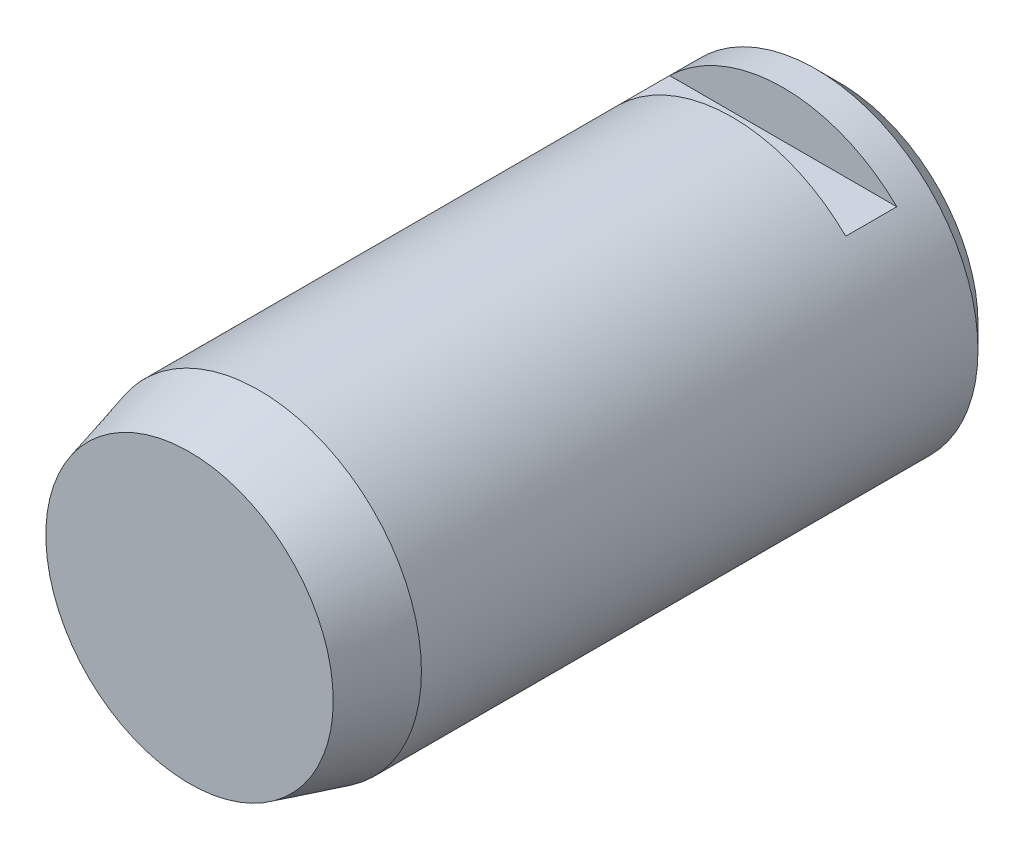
from build123d import *

# Parameters (mm, degrees)
ESQUISSE1_R             = 35
EXTRUSION1_DEPTH        = 140
CHANFREIN1_SIZE         = 15
CHANFREIN1_SIZE2        = 4.019237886
ENL_V_MAT_EXTRU_1_REACH = 158.285
ESQUISSE2_W             = 70
ESQUISSE2_H             = 11
CHANFREIN2_SIZE         = 5


with BuildPart() as part:
    # Esquisse1 → Extrusion1 (new body)
    with BuildSketch(Plane.XY):
        Circle(ESQUISSE1_R)
    extrude(amount=EXTRUSION1_DEPTH)

    # Chanfrein1
    chanfrein1_edges = [part.edges().sort_by_distance(p)[0] for p in [
        (-35, 0, 140),
    ]]
    chanfrein1_side = [part.faces().sort_by_distance(p)[0] for p in [
        (-35, 0, 70),
    ]]
    chamfer(chanfrein1_edges, length=CHANFREIN1_SIZE, length2=CHANFREIN1_SIZE2, reference=chanfrein1_side[0])

    # Esquisse2 → Enl_v. mat.-Extru.1 (cut, up to next)
    with BuildSketch(Plane(origin=(0, 25, 0), x_dir=(-1, 0, 0), z_dir=(0, 1, 0)), mode=Mode.PRIVATE) as enl_v_mat_extru_1_sk1:
        with Locations((0, 17.5)):
            Rectangle(ESQUISSE2_W, ESQUISSE2_H)
    enl_v_mat_extru_1_tool1 = extrude(enl_v_mat_extru_1_sk1.sketch, amount=ENL_V_MAT_EXTRU_1_REACH, mode=Mode.PRIVATE) & part.part
    add(enl_v_mat_extru_1_tool1.solids().sort_by_distance((0, 25, 17.5))[0], mode=Mode.SUBTRACT)

    # Chanfrein2
    chanfrein2_edges = [part.edges().sort_by_distance(p)[0] for p in [
        (-35, 0, 0),
    ]]
    chamfer(chanfrein2_edges, length=CHANFREIN2_SIZE)


solid = part.part
